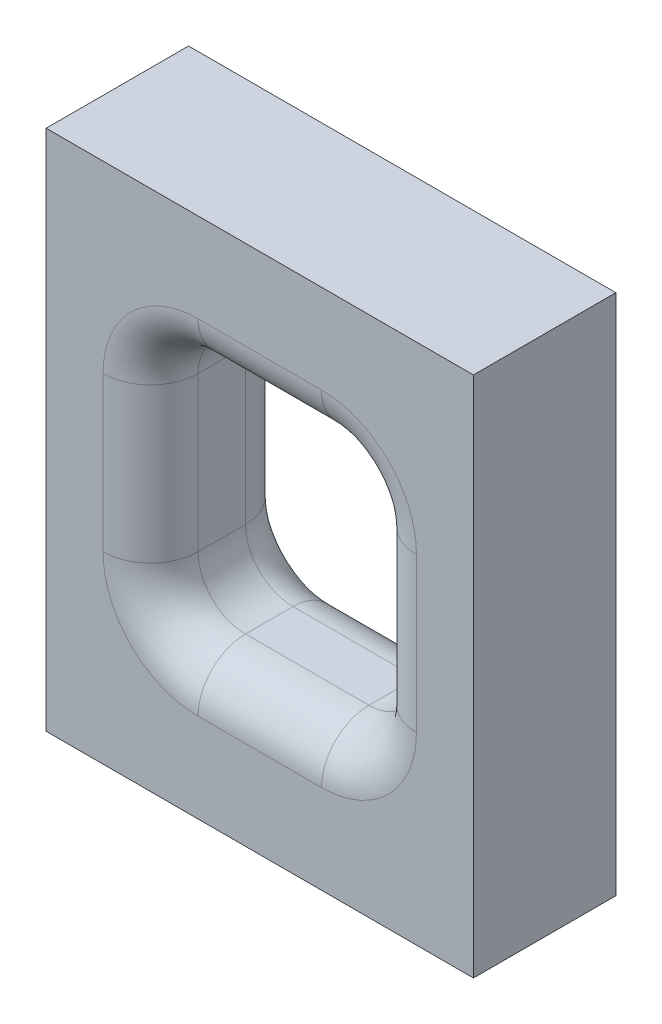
from build123d import *

# Parameters (mm, degrees)
BOSS_EXTRUDE1_DEPTH = 3
FILLET3_R           = 1


with BuildPart() as part:
    # Sketch1 → Boss-Extrude1 (new body)
    with BuildSketch(Plane.XY):
        Polygon((4.5, -4.5), (4.5, -5.5), (-4.5, -5.5), (-4.5, -4.5), (-4.5, 4.5), (-4.5, 5.5), (-3.5, 5.5), (3.5, 5.5), (4.5, 5.5), (4.5, 4.5), align=None)
        with BuildLine():
            Line((-1.3, 2.625), (1.3, 2.625))
            ThreePointArc((1.3, 2.625), (2.007106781, 2.332106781), (2.3, 1.625))
            Line((2.3, 1.625), (2.3, -1.625))
            ThreePointArc((2.3, -1.625), (2.007106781, -2.332106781), (1.3, -2.625))
            Line((1.3, -2.625), (-1.3, -2.625))
            ThreePointArc((-1.3, -2.625), (-2.007106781, -2.332106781), (-2.3, -1.625))
            Line((-2.3, -1.625), (-2.3, 1.625))
            ThreePointArc((-2.3, 1.625), (-2.007106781, 2.332106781), (-1.3, 2.625))
        make_face(mode=Mode.SUBTRACT)
    extrude(amount=BOSS_EXTRUDE1_DEPTH)

    # Fillet3
    fillet3_edges = [part.edges().sort_by_distance(p)[0] for p in [
        (2.007106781, 2.332106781, 0),
        (0, 2.625, 0),
        (-2.007106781, 2.332106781, 0),
        (-2.3, 0, 0),
        (-2.007106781, -2.332106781, 0),
        (0, -2.625, 0),
        (2.007106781, -2.332106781, 0),
        (2.3, 0, 0),
        (2.007106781, 2.332106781, 3),
        (0, 2.625, 3),
        (-2.007106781, 2.332106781, 3),
        (-2.3, 0, 3),
        (-2.007106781, -2.332106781, 3),
        (0, -2.625, 3),
        (2.007106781, -2.332106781, 3),
        (2.3, 0, 3),
    ]]
    fillet(fillet3_edges, radius=FILLET3_R)


solid = part.part
